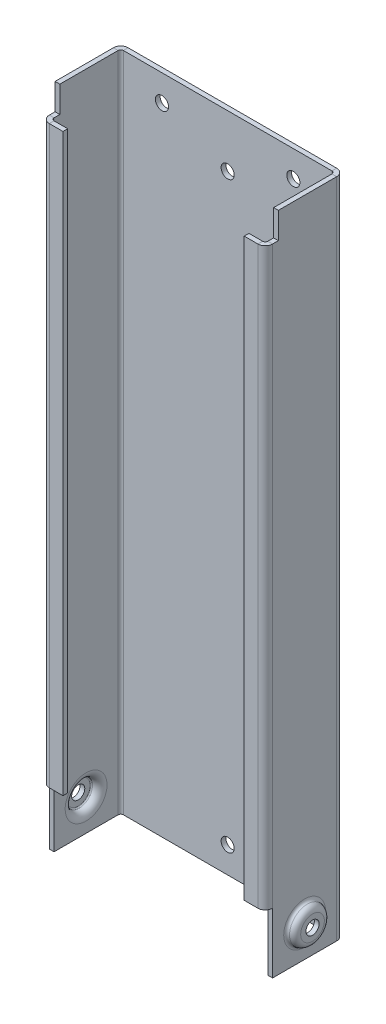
ISO-10303-21;
HEADER;
FILE_DESCRIPTION(('STEP AP214'),'2;1');
FILE_NAME('part.step','',(''),(''),'','','');
FILE_SCHEMA(('AUTOMOTIVE_DESIGN { 1 0 10303 214 1 1 1 1 }'));
ENDSEC;
DATA;
#1=APPLICATION_CONTEXT('core data for automotive mechanical design processes');
#2=APPLICATION_PROTOCOL_DEFINITION('international standard','automotive_design',2000,#1);
#3=PRODUCT_CONTEXT('',#1,'mechanical');
#4=PRODUCT('Part','Part','',(#3));
#5=PRODUCT_RELATED_PRODUCT_CATEGORY('part','',(#4));
#6=PRODUCT_DEFINITION_FORMATION('','',#4);
#7=PRODUCT_DEFINITION_CONTEXT('part definition',#1,'design');
#8=PRODUCT_DEFINITION('design','',#6,#7);
#9=PRODUCT_DEFINITION_SHAPE('','',#8);
#10=(LENGTH_UNIT() NAMED_UNIT(*) SI_UNIT(.MILLI.,.METRE.));
#11=(NAMED_UNIT(*) PLANE_ANGLE_UNIT() SI_UNIT($,.RADIAN.));
#12=(NAMED_UNIT(*) SI_UNIT($,.STERADIAN.) SOLID_ANGLE_UNIT());
#13=UNCERTAINTY_MEASURE_WITH_UNIT(LENGTH_MEASURE(1.E-05),#10,'distance_accuracy_value','');
#14=(GEOMETRIC_REPRESENTATION_CONTEXT(3) GLOBAL_UNCERTAINTY_ASSIGNED_CONTEXT((#13)) GLOBAL_UNIT_ASSIGNED_CONTEXT((#10,
#11,#12)) REPRESENTATION_CONTEXT('',''));
#15=CARTESIAN_POINT('',(0.,0.,0.));
#16=DIRECTION('',(0.,0.,1.));
#17=DIRECTION('',(1.,0.,0.));
#18=AXIS2_PLACEMENT_3D('',#15,#16,#17);
#19=CARTESIAN_POINT('',(-45.5000000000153,242.,25.));
#20=DIRECTION('',(0.,-1.,0.));
#21=DIRECTION('',(0.,0.,-1.));
#22=AXIS2_PLACEMENT_3D('',#19,#20,#21);
#23=PLANE('',#22);
#24=DIRECTION('',(1.,0.,0.));
#25=VECTOR('',#24,1.);
#26=CARTESIAN_POINT('',(-42.5,242.,28.2));
#27=LINE('',#26,#25);
#28=CARTESIAN_POINT('',(-39.7,242.,28.2));
#29=VERTEX_POINT('',#28);
#30=CARTESIAN_POINT('',(-34.5,242.,28.2));
#31=VERTEX_POINT('',#30);
#32=EDGE_CURVE('E371',#29,#31,#27,.T.);
#33=ORIENTED_EDGE('',*,*,#32,.F.);
#34=DIRECTION('',(0.,0.,1.));
#35=VECTOR('',#34,1.);
#36=CARTESIAN_POINT('',(-39.7,242.,28.2));
#37=LINE('',#36,#35);
#38=CARTESIAN_POINT('',(-39.7,242.,30.));
#39=VERTEX_POINT('',#38);
#40=EDGE_CURVE('E12',#29,#39,#37,.T.);
#41=ORIENTED_EDGE('',*,*,#40,.T.);
#42=DIRECTION('',(1.,0.,0.));
#43=VECTOR('',#42,1.);
#44=CARTESIAN_POINT('',(-45.5000000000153,242.,30.));
#45=LINE('',#44,#43);
#46=CARTESIAN_POINT('',(-34.5,242.,30.));
#47=VERTEX_POINT('',#46);
#48=EDGE_CURVE('E255',#39,#47,#45,.T.);
#49=ORIENTED_EDGE('',*,*,#48,.T.);
#50=DIRECTION('',(0.,0.,-1.));
#51=VECTOR('',#50,1.);
#52=CARTESIAN_POINT('',(-34.5,242.,28.2));
#53=LINE('',#52,#51);
#54=EDGE_CURVE('E374',#47,#31,#53,.T.);
#55=ORIENTED_EDGE('',*,*,#54,.T.);
#56=EDGE_LOOP('',(#33,#41,#49,#55));
#57=FACE_BOUND('',#56,.T.);
#58=ADVANCED_FACE('F48',(#57),#23,.F.);
#59=DIRECTION('',(0.,0.,1.));
#60=VECTOR('',#59,1.);
#61=CARTESIAN_POINT('',(-42.5,242.,0.));
#62=LINE('',#61,#60);
#63=CARTESIAN_POINT('',(-42.5,242.,25.));
#64=VERTEX_POINT('',#63);
#65=CARTESIAN_POINT('',(-42.5,242.,27.2));
#66=VERTEX_POINT('',#65);
#67=EDGE_CURVE('E350',#64,#66,#62,.T.);
#68=ORIENTED_EDGE('',*,*,#67,.T.);
#69=DIRECTION('',(1.,0.,0.));
#70=VECTOR('',#69,1.);
#71=CARTESIAN_POINT('',(-42.5,242.,27.2));
#72=LINE('',#71,#70);
#73=CARTESIAN_POINT('',(-40.7,242.,27.2));
#74=VERTEX_POINT('',#73);
#75=EDGE_CURVE('E57',#66,#74,#72,.T.);
#76=ORIENTED_EDGE('',*,*,#75,.T.);
#77=DIRECTION('',(0.,0.,1.));
#78=VECTOR('',#77,1.);
#79=CARTESIAN_POINT('',(-40.7,242.,0.));
#80=LINE('',#79,#78);
#81=CARTESIAN_POINT('',(-40.7,242.,25.));
#82=VERTEX_POINT('',#81);
#83=EDGE_CURVE('E365',#82,#74,#80,.T.);
#84=ORIENTED_EDGE('',*,*,#83,.F.);
#85=DIRECTION('',(1.,0.,0.));
#86=VECTOR('',#85,1.);
#87=CARTESIAN_POINT('',(-45.5000000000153,242.,25.));
#88=LINE('',#87,#86);
#89=EDGE_CURVE('E525',#64,#82,#88,.T.);
#90=ORIENTED_EDGE('',*,*,#89,.F.);
#91=EDGE_LOOP('',(#68,#76,#84,#90));
#92=FACE_BOUND('',#91,.T.);
#93=ADVANCED_FACE('F647',(#92),#23,.F.);
#94=CARTESIAN_POINT('',(-45.5000000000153,23.,30.));
#95=DIRECTION('',(0.,1.,0.));
#96=DIRECTION('',(0.,0.,1.));
#97=AXIS2_PLACEMENT_3D('',#94,#95,#96);
#98=PLANE('',#97);
#99=DIRECTION('',(1.,0.,0.));
#100=VECTOR('',#99,1.);
#101=CARTESIAN_POINT('',(-45.5000000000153,23.,30.));
#102=LINE('',#101,#100);
#103=CARTESIAN_POINT('',(-39.7,23.,30.));
#104=VERTEX_POINT('',#103);
#105=CARTESIAN_POINT('',(-34.5,23.,30.));
#106=VERTEX_POINT('',#105);
#107=EDGE_CURVE('E233',#104,#106,#102,.T.);
#108=ORIENTED_EDGE('',*,*,#107,.F.);
#109=DIRECTION('',(0.,0.,-1.));
#110=VECTOR('',#109,1.);
#111=CARTESIAN_POINT('',(-39.7,23.,30.));
#112=LINE('',#111,#110);
#113=CARTESIAN_POINT('',(-39.7,23.,28.2));
#114=VERTEX_POINT('',#113);
#115=EDGE_CURVE('E219',#104,#114,#112,.T.);
#116=ORIENTED_EDGE('',*,*,#115,.T.);
#117=DIRECTION('',(-1.,0.,0.));
#118=VECTOR('',#117,1.);
#119=CARTESIAN_POINT('',(-42.5,23.,28.2));
#120=LINE('',#119,#118);
#121=CARTESIAN_POINT('',(-34.5,23.,28.2));
#122=VERTEX_POINT('',#121);
#123=EDGE_CURVE('E506',#122,#114,#120,.T.);
#124=ORIENTED_EDGE('',*,*,#123,.F.);
#125=DIRECTION('',(0.,0.,1.));
#126=VECTOR('',#125,1.);
#127=CARTESIAN_POINT('',(-34.5,23.,28.2));
#128=LINE('',#127,#126);
#129=EDGE_CURVE('E236',#122,#106,#128,.T.);
#130=ORIENTED_EDGE('',*,*,#129,.T.);
#131=EDGE_LOOP('',(#108,#116,#124,#130));
#132=FACE_BOUND('',#131,.T.);
#133=ADVANCED_FACE('F234',(#132),#98,.F.);
#134=DIRECTION('',(0.,0.,-1.));
#135=VECTOR('',#134,1.);
#136=CARTESIAN_POINT('',(40.7,242.,0.));
#137=LINE('',#136,#135);
#138=CARTESIAN_POINT('',(40.7,242.,27.2));
#139=VERTEX_POINT('',#138);
#140=CARTESIAN_POINT('',(40.7,242.,25.));
#141=VERTEX_POINT('',#140);
#142=EDGE_CURVE('E331',#139,#141,#137,.T.);
#143=ORIENTED_EDGE('',*,*,#142,.F.);
#144=DIRECTION('',(1.,0.,0.));
#145=VECTOR('',#144,1.);
#146=CARTESIAN_POINT('',(40.7,242.,27.2));
#147=LINE('',#146,#145);
#148=CARTESIAN_POINT('',(42.5,242.,27.2));
#149=VERTEX_POINT('',#148);
#150=EDGE_CURVE('E230',#139,#149,#147,.T.);
#151=ORIENTED_EDGE('',*,*,#150,.T.);
#152=DIRECTION('',(0.,0.,-1.));
#153=VECTOR('',#152,1.);
#154=CARTESIAN_POINT('',(42.5,242.,0.));
#155=LINE('',#154,#153);
#156=CARTESIAN_POINT('',(42.5,242.,25.));
#157=VERTEX_POINT('',#156);
#158=EDGE_CURVE('E328',#149,#157,#155,.T.);
#159=ORIENTED_EDGE('',*,*,#158,.T.);
#160=EDGE_CURVE('E536',#141,#157,#88,.T.);
#161=ORIENTED_EDGE('',*,*,#160,.F.);
#162=EDGE_LOOP('',(#143,#151,#159,#161));
#163=FACE_BOUND('',#162,.T.);
#164=ADVANCED_FACE('F325',(#163),#23,.F.);
#165=CARTESIAN_POINT('',(34.5,242.,30.));
#166=VERTEX_POINT('',#165);
#167=CARTESIAN_POINT('',(39.7,242.,30.));
#168=VERTEX_POINT('',#167);
#169=EDGE_CURVE('E534',#166,#168,#45,.T.);
#170=ORIENTED_EDGE('',*,*,#169,.T.);
#171=DIRECTION('',(0.,0.,-1.));
#172=VECTOR('',#171,1.);
#173=CARTESIAN_POINT('',(39.7,242.,30.));
#174=LINE('',#173,#172);
#175=CARTESIAN_POINT('',(39.7,242.,28.2));
#176=VERTEX_POINT('',#175);
#177=EDGE_CURVE('E319',#168,#176,#174,.T.);
#178=ORIENTED_EDGE('',*,*,#177,.T.);
#179=DIRECTION('',(1.,0.,0.));
#180=VECTOR('',#179,1.);
#181=CARTESIAN_POINT('',(42.5,242.,28.2));
#182=LINE('',#181,#180);
#183=CARTESIAN_POINT('',(34.5,242.,28.2));
#184=VERTEX_POINT('',#183);
#185=EDGE_CURVE('E357',#184,#176,#182,.T.);
#186=ORIENTED_EDGE('',*,*,#185,.F.);
#187=DIRECTION('',(0.,0.,1.));
#188=VECTOR('',#187,1.);
#189=CARTESIAN_POINT('',(34.5,242.,30.));
#190=LINE('',#189,#188);
#191=EDGE_CURVE('E363',#184,#166,#190,.T.);
#192=ORIENTED_EDGE('',*,*,#191,.T.);
#193=EDGE_LOOP('',(#170,#178,#186,#192));
#194=FACE_BOUND('',#193,.T.);
#195=ADVANCED_FACE('F630',(#194),#23,.F.);
#196=CARTESIAN_POINT('',(-39.7,252.,28.2));
#197=DIRECTION('',(0.,1.,0.));
#198=DIRECTION('',(0.,0.,1.));
#199=AXIS2_PLACEMENT_3D('',#196,#197,#198);
#200=PLANE('',#199);
#201=DIRECTION('',(1.,0.,0.));
#202=VECTOR('',#201,1.);
#203=CARTESIAN_POINT('',(-45.5000000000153,252.,25.));
#204=LINE('',#203,#202);
#205=CARTESIAN_POINT('',(-42.5,252.,25.));
#206=VERTEX_POINT('',#205);
#207=CARTESIAN_POINT('',(-40.7,252.,25.));
#208=VERTEX_POINT('',#207);
#209=EDGE_CURVE('E533',#206,#208,#204,.T.);
#210=ORIENTED_EDGE('',*,*,#209,.T.);
#211=DIRECTION('',(0.,0.,-1.));
#212=VECTOR('',#211,1.);
#213=CARTESIAN_POINT('',(-40.7,252.,0.));
#214=LINE('',#213,#212);
#215=CARTESIAN_POINT('',(-40.7,252.,2.8));
#216=VERTEX_POINT('',#215);
#217=EDGE_CURVE('E436',#208,#216,#214,.T.);
#218=ORIENTED_EDGE('',*,*,#217,.T.);
#219=DIRECTION('',(-1.,0.,0.));
#220=VECTOR('',#219,1.);
#221=CARTESIAN_POINT('',(-40.7,252.,2.8));
#222=LINE('',#221,#220);
#223=CARTESIAN_POINT('',(-42.5,252.,2.8));
#224=VERTEX_POINT('',#223);
#225=EDGE_CURVE('E302',#216,#224,#222,.T.);
#226=ORIENTED_EDGE('',*,*,#225,.T.);
#227=DIRECTION('',(0.,0.,-1.));
#228=VECTOR('',#227,1.);
#229=CARTESIAN_POINT('',(-42.5,252.,0.));
#230=LINE('',#229,#228);
#231=EDGE_CURVE('E434',#206,#224,#230,.T.);
#232=ORIENTED_EDGE('',*,*,#231,.F.);
#233=EDGE_LOOP('',(#210,#218,#226,#232));
#234=FACE_BOUND('',#233,.T.);
#235=ADVANCED_FACE('F50',(#234),#200,.T.);
#236=CARTESIAN_POINT('',(-39.7,252.,0.));
#237=DIRECTION('',(0.,1.,0.));
#238=DIRECTION('',(0.,0.,1.));
#239=AXIS2_PLACEMENT_3D('',#236,#237,#238);
#240=PLANE('',#239);
#241=DIRECTION('',(0.,0.,1.));
#242=VECTOR('',#241,1.);
#243=CARTESIAN_POINT('',(-39.7,252.,0.));
#244=LINE('',#243,#242);
#245=CARTESIAN_POINT('',(-39.7,252.,0.));
#246=VERTEX_POINT('',#245);
#247=CARTESIAN_POINT('',(-39.7,252.,1.8));
#248=VERTEX_POINT('',#247);
#249=EDGE_CURVE('E305',#246,#248,#244,.T.);
#250=ORIENTED_EDGE('',*,*,#249,.F.);
#251=CARTESIAN_POINT('',(-39.7,252.,2.8));
#252=DIRECTION('',(0.,1.,0.));
#253=DIRECTION('',(0.,0.,1.));
#254=AXIS2_PLACEMENT_3D('',#251,#252,#253);
#255=CIRCLE('',#254,2.8);
#256=EDGE_CURVE('E431',#224,#246,#255,.F.);
#257=ORIENTED_EDGE('',*,*,#256,.F.);
#258=ORIENTED_EDGE('',*,*,#225,.F.);
#259=CARTESIAN_POINT('',(-39.7,252.,2.8));
#260=DIRECTION('',(0.,1.,0.));
#261=DIRECTION('',(1.,0.,0.));
#262=AXIS2_PLACEMENT_3D('',#259,#260,#261);
#263=CIRCLE('',#262,1.);
#264=EDGE_CURVE('E438',#216,#248,#263,.F.);
#265=ORIENTED_EDGE('',*,*,#264,.T.);
#266=EDGE_LOOP('',(#250,#257,#258,#265));
#267=FACE_BOUND('',#266,.T.);
#268=ADVANCED_FACE('F681',(#267),#240,.T.);
#269=CARTESIAN_POINT('',(-40.7,252.,2.8));
#270=DIRECTION('',(0.,1.,0.));
#271=DIRECTION('',(0.,0.,1.));
#272=AXIS2_PLACEMENT_3D('',#269,#270,#271);
#273=PLANE('',#272);
#274=DIRECTION('',(1.,0.,0.));
#275=VECTOR('',#274,1.);
#276=CARTESIAN_POINT('',(-42.5,252.,0.));
#277=LINE('',#276,#275);
#278=CARTESIAN_POINT('',(39.7,252.,0.));
#279=VERTEX_POINT('',#278);
#280=EDGE_CURVE('E428',#246,#279,#277,.T.);
#281=ORIENTED_EDGE('',*,*,#280,.F.);
#282=ORIENTED_EDGE('',*,*,#249,.T.);
#283=DIRECTION('',(1.,0.,0.));
#284=VECTOR('',#283,1.);
#285=CARTESIAN_POINT('',(-42.5,252.,1.8));
#286=LINE('',#285,#284);
#287=CARTESIAN_POINT('',(39.7,252.,1.8));
#288=VERTEX_POINT('',#287);
#289=EDGE_CURVE('E441',#248,#288,#286,.T.);
#290=ORIENTED_EDGE('',*,*,#289,.T.);
#291=DIRECTION('',(0.,0.,-1.));
#292=VECTOR('',#291,1.);
#293=CARTESIAN_POINT('',(39.7,252.,1.8));
#294=LINE('',#293,#292);
#295=EDGE_CURVE('E294',#288,#279,#294,.T.);
#296=ORIENTED_EDGE('',*,*,#295,.T.);
#297=EDGE_LOOP('',(#281,#282,#290,#296));
#298=FACE_BOUND('',#297,.T.);
#299=ADVANCED_FACE('F1417',(#298),#273,.T.);
#300=CARTESIAN_POINT('',(-42.5,0.,2.8));
#301=DIRECTION('',(0.,-1.,0.));
#302=DIRECTION('',(0.,0.,-1.));
#303=AXIS2_PLACEMENT_3D('',#300,#301,#302);
#304=PLANE('',#303);
#305=DIRECTION('',(1.,0.,0.));
#306=VECTOR('',#305,1.);
#307=CARTESIAN_POINT('',(-42.5,0.,2.8));
#308=LINE('',#307,#306);
#309=CARTESIAN_POINT('',(-42.5,0.,2.8));
#310=VERTEX_POINT('',#309);
#311=CARTESIAN_POINT('',(-40.7,0.,2.8));
#312=VERTEX_POINT('',#311);
#313=EDGE_CURVE('E300',#310,#312,#308,.T.);
#314=ORIENTED_EDGE('',*,*,#313,.F.);
#315=CARTESIAN_POINT('',(-39.7,0.,2.8));
#316=DIRECTION('',(0.,1.,0.));
#317=DIRECTION('',(0.,0.,1.));
#318=AXIS2_PLACEMENT_3D('',#315,#316,#317);
#319=CIRCLE('',#318,2.8);
#320=CARTESIAN_POINT('',(-39.7,0.,0.));
#321=VERTEX_POINT('',#320);
#322=EDGE_CURVE('E459',#310,#321,#319,.F.);
#323=ORIENTED_EDGE('',*,*,#322,.T.);
#324=DIRECTION('',(0.,0.,-1.));
#325=VECTOR('',#324,1.);
#326=CARTESIAN_POINT('',(-39.7,0.,1.8));
#327=LINE('',#326,#325);
#328=CARTESIAN_POINT('',(-39.7,0.,1.8));
#329=VERTEX_POINT('',#328);
#330=EDGE_CURVE('E298',#329,#321,#327,.T.);
#331=ORIENTED_EDGE('',*,*,#330,.F.);
#332=CARTESIAN_POINT('',(-39.7,0.,2.8));
#333=DIRECTION('',(0.,1.,0.));
#334=DIRECTION('',(1.,0.,0.));
#335=AXIS2_PLACEMENT_3D('',#332,#333,#334);
#336=CIRCLE('',#335,1.);
#337=EDGE_CURVE('E468',#312,#329,#336,.F.);
#338=ORIENTED_EDGE('',*,*,#337,.F.);
#339=EDGE_LOOP('',(#314,#323,#331,#338));
#340=FACE_BOUND('',#339,.T.);
#341=ADVANCED_FACE('F1404',(#340),#304,.T.);
#342=CARTESIAN_POINT('',(-39.7,0.,1.8));
#343=DIRECTION('',(0.,-1.,0.));
#344=DIRECTION('',(0.,0.,-1.));
#345=AXIS2_PLACEMENT_3D('',#342,#343,#344);
#346=PLANE('',#345);
#347=DIRECTION('',(0.,0.,-1.));
#348=VECTOR('',#347,1.);
#349=CARTESIAN_POINT('',(-42.5,0.,0.));
#350=LINE('',#349,#348);
#351=CARTESIAN_POINT('',(-42.5,0.,27.2));
#352=VERTEX_POINT('',#351);
#353=EDGE_CURVE('E462',#352,#310,#350,.T.);
#354=ORIENTED_EDGE('',*,*,#353,.T.);
#355=ORIENTED_EDGE('',*,*,#313,.T.);
#356=DIRECTION('',(0.,0.,-1.));
#357=VECTOR('',#356,1.);
#358=CARTESIAN_POINT('',(-40.7,0.,0.));
#359=LINE('',#358,#357);
#360=CARTESIAN_POINT('',(-40.7,0.,27.2));
#361=VERTEX_POINT('',#360);
#362=EDGE_CURVE('E465',#361,#312,#359,.T.);
#363=ORIENTED_EDGE('',*,*,#362,.F.);
#364=DIRECTION('',(-1.,0.,0.));
#365=VECTOR('',#364,1.);
#366=CARTESIAN_POINT('',(-40.7,0.,27.2));
#367=LINE('',#366,#365);
#368=EDGE_CURVE('E307',#361,#352,#367,.T.);
#369=ORIENTED_EDGE('',*,*,#368,.T.);
#370=EDGE_LOOP('',(#354,#355,#363,#369));
#371=FACE_BOUND('',#370,.T.);
#372=ADVANCED_FACE('F1392',(#371),#346,.T.);
#373=CARTESIAN_POINT('',(42.5,252.,2.8));
#374=DIRECTION('',(0.,1.,0.));
#375=DIRECTION('',(0.,0.,1.));
#376=AXIS2_PLACEMENT_3D('',#373,#374,#375);
#377=PLANE('',#376);
#378=DIRECTION('',(-1.,0.,0.));
#379=VECTOR('',#378,1.);
#380=CARTESIAN_POINT('',(42.5,252.,2.8));
#381=LINE('',#380,#379);
#382=CARTESIAN_POINT('',(42.5,252.,2.8));
#383=VERTEX_POINT('',#382);
#384=CARTESIAN_POINT('',(40.7,252.,2.8));
#385=VERTEX_POINT('',#384);
#386=EDGE_CURVE('E296',#383,#385,#381,.T.);
#387=ORIENTED_EDGE('',*,*,#386,.F.);
#388=CARTESIAN_POINT('',(39.7,252.,2.8));
#389=DIRECTION('',(0.,1.,0.));
#390=DIRECTION('',(0.,0.,1.));
#391=AXIS2_PLACEMENT_3D('',#388,#389,#390);
#392=CIRCLE('',#391,2.8);
#393=EDGE_CURVE('E424',#279,#383,#392,.F.);
#394=ORIENTED_EDGE('',*,*,#393,.F.);
#395=ORIENTED_EDGE('',*,*,#295,.F.);
#396=CARTESIAN_POINT('',(39.7,252.,2.8));
#397=DIRECTION('',(0.,1.,0.));
#398=DIRECTION('',(1.,0.,0.));
#399=AXIS2_PLACEMENT_3D('',#396,#397,#398);
#400=CIRCLE('',#399,1.);
#401=EDGE_CURVE('E444',#288,#385,#400,.F.);
#402=ORIENTED_EDGE('',*,*,#401,.T.);
#403=EDGE_LOOP('',(#387,#394,#395,#402));
#404=FACE_BOUND('',#403,.T.);
#405=ADVANCED_FACE('F1379',(#404),#377,.T.);
#406=CARTESIAN_POINT('',(39.7,252.,1.8));
#407=DIRECTION('',(0.,1.,0.));
#408=DIRECTION('',(0.,0.,1.));
#409=AXIS2_PLACEMENT_3D('',#406,#407,#408);
#410=PLANE('',#409);
#411=CARTESIAN_POINT('',(40.7,252.,25.));
#412=VERTEX_POINT('',#411);
#413=CARTESIAN_POINT('',(42.5,252.,25.));
#414=VERTEX_POINT('',#413);
#415=EDGE_CURVE('E530',#412,#414,#204,.T.);
#416=ORIENTED_EDGE('',*,*,#415,.T.);
#417=DIRECTION('',(0.,0.,1.));
#418=VECTOR('',#417,1.);
#419=CARTESIAN_POINT('',(42.5,252.,0.));
#420=LINE('',#419,#418);
#421=EDGE_CURVE('E422',#383,#414,#420,.T.);
#422=ORIENTED_EDGE('',*,*,#421,.F.);
#423=ORIENTED_EDGE('',*,*,#386,.T.);
#424=DIRECTION('',(0.,0.,1.));
#425=VECTOR('',#424,1.);
#426=CARTESIAN_POINT('',(40.7,252.,0.));
#427=LINE('',#426,#425);
#428=EDGE_CURVE('E447',#385,#412,#427,.T.);
#429=ORIENTED_EDGE('',*,*,#428,.T.);
#430=EDGE_LOOP('',(#416,#422,#423,#429));
#431=FACE_BOUND('',#430,.T.);
#432=ADVANCED_FACE('F1367',(#431),#410,.T.);
#433=CARTESIAN_POINT('',(39.7,0.,0.));
#434=DIRECTION('',(0.,-1.,0.));
#435=DIRECTION('',(0.,0.,-1.));
#436=AXIS2_PLACEMENT_3D('',#433,#434,#435);
#437=PLANE('',#436);
#438=DIRECTION('',(0.,0.,1.));
#439=VECTOR('',#438,1.);
#440=CARTESIAN_POINT('',(39.7,0.,0.));
#441=LINE('',#440,#439);
#442=CARTESIAN_POINT('',(39.7,0.,0.));
#443=VERTEX_POINT('',#442);
#444=CARTESIAN_POINT('',(39.7,0.,1.8));
#445=VERTEX_POINT('',#444);
#446=EDGE_CURVE('E292',#443,#445,#441,.T.);
#447=ORIENTED_EDGE('',*,*,#446,.F.);
#448=CARTESIAN_POINT('',(39.7,0.,2.8));
#449=DIRECTION('',(0.,1.,0.));
#450=DIRECTION('',(0.,0.,1.));
#451=AXIS2_PLACEMENT_3D('',#448,#449,#450);
#452=CIRCLE('',#451,2.8);
#453=CARTESIAN_POINT('',(42.5,0.,2.8));
#454=VERTEX_POINT('',#453);
#455=EDGE_CURVE('E453',#443,#454,#452,.F.);
#456=ORIENTED_EDGE('',*,*,#455,.T.);
#457=DIRECTION('',(1.,0.,0.));
#458=VECTOR('',#457,1.);
#459=CARTESIAN_POINT('',(40.7,0.,2.8));
#460=LINE('',#459,#458);
#461=CARTESIAN_POINT('',(40.7,0.,2.8));
#462=VERTEX_POINT('',#461);
#463=EDGE_CURVE('E290',#462,#454,#460,.T.);
#464=ORIENTED_EDGE('',*,*,#463,.F.);
#465=CARTESIAN_POINT('',(39.7,0.,2.8));
#466=DIRECTION('',(0.,1.,0.));
#467=DIRECTION('',(1.,0.,0.));
#468=AXIS2_PLACEMENT_3D('',#465,#466,#467);
#469=CIRCLE('',#468,1.);
#470=EDGE_CURVE('E474',#445,#462,#469,.F.);
#471=ORIENTED_EDGE('',*,*,#470,.F.);
#472=EDGE_LOOP('',(#447,#456,#464,#471));
#473=FACE_BOUND('',#472,.T.);
#474=ADVANCED_FACE('F603',(#473),#437,.T.);
#475=CARTESIAN_POINT('',(40.7,0.,2.8));
#476=DIRECTION('',(0.,-1.,0.));
#477=DIRECTION('',(0.,0.,-1.));
#478=AXIS2_PLACEMENT_3D('',#475,#476,#477);
#479=PLANE('',#478);
#480=DIRECTION('',(1.,0.,0.));
#481=VECTOR('',#480,1.);
#482=CARTESIAN_POINT('',(-42.5,0.,0.));
#483=LINE('',#482,#481);
#484=EDGE_CURVE('E456',#321,#443,#483,.T.);
#485=ORIENTED_EDGE('',*,*,#484,.T.);
#486=ORIENTED_EDGE('',*,*,#446,.T.);
#487=DIRECTION('',(1.,0.,0.));
#488=VECTOR('',#487,1.);
#489=CARTESIAN_POINT('',(-42.5,0.,1.8));
#490=LINE('',#489,#488);
#491=EDGE_CURVE('E471',#329,#445,#490,.T.);
#492=ORIENTED_EDGE('',*,*,#491,.F.);
#493=ORIENTED_EDGE('',*,*,#330,.T.);
#494=EDGE_LOOP('',(#485,#486,#492,#493));
#495=FACE_BOUND('',#494,.T.);
#496=ADVANCED_FACE('F1344',(#495),#479,.T.);
#497=CARTESIAN_POINT('',(39.7,0.,28.2));
#498=DIRECTION('',(0.,-1.,0.));
#499=DIRECTION('',(0.,0.,-1.));
#500=AXIS2_PLACEMENT_3D('',#497,#498,#499);
#501=PLANE('',#500);
#502=DIRECTION('',(0.,0.,1.));
#503=VECTOR('',#502,1.);
#504=CARTESIAN_POINT('',(42.5,0.,0.));
#505=LINE('',#504,#503);
#506=CARTESIAN_POINT('',(42.5,0.,27.2));
#507=VERTEX_POINT('',#506);
#508=EDGE_CURVE('E421',#454,#507,#505,.T.);
#509=ORIENTED_EDGE('',*,*,#508,.T.);
#510=DIRECTION('',(-1.,0.,0.));
#511=VECTOR('',#510,1.);
#512=CARTESIAN_POINT('',(42.5,0.,27.2));
#513=LINE('',#512,#511);
#514=CARTESIAN_POINT('',(40.7,0.,27.2));
#515=VERTEX_POINT('',#514);
#516=EDGE_CURVE('E287',#507,#515,#513,.T.);
#517=ORIENTED_EDGE('',*,*,#516,.T.);
#518=DIRECTION('',(0.,0.,1.));
#519=VECTOR('',#518,1.);
#520=CARTESIAN_POINT('',(40.7,0.,0.));
#521=LINE('',#520,#519);
#522=EDGE_CURVE('E425',#462,#515,#521,.T.);
#523=ORIENTED_EDGE('',*,*,#522,.F.);
#524=ORIENTED_EDGE('',*,*,#463,.T.);
#525=EDGE_LOOP('',(#509,#517,#523,#524));
#526=FACE_BOUND('',#525,.T.);
#527=ADVANCED_FACE('F607',(#526),#501,.T.);
#528=CARTESIAN_POINT('',(42.5,252.,28.2));
#529=DIRECTION('',(0.,0.,1.));
#530=DIRECTION('',(1.,0.,0.));
#531=AXIS2_PLACEMENT_3D('',#528,#529,#530);
#532=PLANE('',#531);
#533=DIRECTION('',(0.,-1.,0.));
#534=VECTOR('',#533,1.);
#535=CARTESIAN_POINT('',(34.5,252.,28.2));
#536=LINE('',#535,#534);
#537=CARTESIAN_POINT('',(34.5,23.,28.2));
#538=VERTEX_POINT('',#537);
#539=EDGE_CURVE('E284',#184,#538,#536,.T.);
#540=ORIENTED_EDGE('',*,*,#539,.F.);
#541=ORIENTED_EDGE('',*,*,#185,.T.);
#542=DIRECTION('',(0.,-1.,0.));
#543=VECTOR('',#542,1.);
#544=CARTESIAN_POINT('',(39.7,252.,28.2));
#545=LINE('',#544,#543);
#546=CARTESIAN_POINT('',(39.7,23.,28.2));
#547=VERTEX_POINT('',#546);
#548=EDGE_CURVE('E450',#176,#547,#545,.T.);
#549=ORIENTED_EDGE('',*,*,#548,.T.);
#550=DIRECTION('',(-1.,0.,0.));
#551=VECTOR('',#550,1.);
#552=CARTESIAN_POINT('',(42.5,23.,28.2));
#553=LINE('',#552,#551);
#554=EDGE_CURVE('E516',#547,#538,#553,.T.);
#555=ORIENTED_EDGE('',*,*,#554,.T.);
#556=EDGE_LOOP('',(#540,#541,#549,#555));
#557=FACE_BOUND('',#556,.T.);
#558=ADVANCED_FACE('F627',(#557),#532,.F.);
#559=CARTESIAN_POINT('',(34.5,252.,30.));
#560=DIRECTION('',(-1.,0.,0.));
#561=DIRECTION('',(0.,0.,1.));
#562=AXIS2_PLACEMENT_3D('',#559,#560,#561);
#563=PLANE('',#562);
#564=ORIENTED_EDGE('',*,*,#191,.F.);
#565=ORIENTED_EDGE('',*,*,#539,.T.);
#566=DIRECTION('',(0.,0.,-1.));
#567=VECTOR('',#566,1.);
#568=CARTESIAN_POINT('',(34.5,23.,30.));
#569=LINE('',#568,#567);
#570=CARTESIAN_POINT('',(34.5,23.,30.));
#571=VERTEX_POINT('',#570);
#572=EDGE_CURVE('E514',#571,#538,#569,.T.);
#573=ORIENTED_EDGE('',*,*,#572,.F.);
#574=DIRECTION('',(0.,-1.,0.));
#575=VECTOR('',#574,1.);
#576=CARTESIAN_POINT('',(34.5,252.,30.));
#577=LINE('',#576,#575);
#578=EDGE_CURVE('E281',#166,#571,#577,.T.);
#579=ORIENTED_EDGE('',*,*,#578,.F.);
#580=EDGE_LOOP('',(#564,#565,#573,#579));
#581=FACE_BOUND('',#580,.T.);
#582=ADVANCED_FACE('F634',(#581),#563,.T.);
#583=CARTESIAN_POINT('',(42.5,252.,30.));
#584=DIRECTION('',(0.,0.,1.));
#585=DIRECTION('',(1.,0.,0.));
#586=AXIS2_PLACEMENT_3D('',#583,#584,#585);
#587=PLANE('',#586);
#588=ORIENTED_EDGE('',*,*,#169,.F.);
#589=ORIENTED_EDGE('',*,*,#578,.T.);
#590=CARTESIAN_POINT('',(39.7,23.,30.));
#591=VERTEX_POINT('',#590);
#592=EDGE_CURVE('E241',#571,#591,#102,.T.);
#593=ORIENTED_EDGE('',*,*,#592,.T.);
#594=DIRECTION('',(0.,-1.,0.));
#595=VECTOR('',#594,1.);
#596=CARTESIAN_POINT('',(39.7,252.,30.));
#597=LINE('',#596,#595);
#598=EDGE_CURVE('E278',#168,#591,#597,.T.);
#599=ORIENTED_EDGE('',*,*,#598,.F.);
#600=EDGE_LOOP('',(#588,#589,#593,#599));
#601=FACE_BOUND('',#600,.T.);
#602=ADVANCED_FACE('F637',(#601),#587,.T.);
#603=CARTESIAN_POINT('',(39.7,252.,27.2));
#604=DIRECTION('',(0.,-1.,0.));
#605=DIRECTION('',(0.,0.,-1.));
#606=AXIS2_PLACEMENT_3D('',#603,#604,#605);
#607=CYLINDRICAL_SURFACE('',#606,2.8);
#608=CARTESIAN_POINT('',(39.7,242.,27.2));
#609=DIRECTION('',(0.,-1.,0.));
#610=DIRECTION('',(0.,0.,-1.));
#611=AXIS2_PLACEMENT_3D('',#608,#609,#610);
#612=CIRCLE('',#611,2.8);
#613=EDGE_CURVE('E335',#168,#149,#612,.F.);
#614=ORIENTED_EDGE('',*,*,#613,.F.);
#615=ORIENTED_EDGE('',*,*,#598,.T.);
#616=CARTESIAN_POINT('',(39.7,23.,27.2));
#617=DIRECTION('',(0.,1.,0.));
#618=DIRECTION('',(0.,0.,1.));
#619=AXIS2_PLACEMENT_3D('',#616,#617,#618);
#620=CIRCLE('',#619,2.8);
#621=CARTESIAN_POINT('',(42.5,23.,27.2));
#622=VERTEX_POINT('',#621);
#623=EDGE_CURVE('E251',#622,#591,#620,.F.);
#624=ORIENTED_EDGE('',*,*,#623,.F.);
#625=DIRECTION('',(0.,-1.,0.));
#626=VECTOR('',#625,1.);
#627=CARTESIAN_POINT('',(42.5,252.,27.2));
#628=LINE('',#627,#626);
#629=EDGE_CURVE('E275',#149,#622,#628,.T.);
#630=ORIENTED_EDGE('',*,*,#629,.F.);
#631=EDGE_LOOP('',(#614,#615,#624,#630));
#632=FACE_BOUND('',#631,.T.);
#633=ADVANCED_FACE('F353',(#632),#607,.T.);
#634=CARTESIAN_POINT('',(42.5,252.,0.));
#635=DIRECTION('',(1.,0.,0.));
#636=DIRECTION('',(0.,0.,-1.));
#637=AXIS2_PLACEMENT_3D('',#634,#635,#636);
#638=PLANE('',#637);
#639=DIRECTION('',(0.,1.,0.));
#640=VECTOR('',#639,1.);
#641=CARTESIAN_POINT('',(42.5,252.,25.));
#642=LINE('',#641,#640);
#643=EDGE_CURVE('E349',#157,#414,#642,.T.);
#644=ORIENTED_EDGE('',*,*,#643,.F.);
#645=ORIENTED_EDGE('',*,*,#158,.F.);
#646=ORIENTED_EDGE('',*,*,#629,.T.);
#647=DIRECTION('',(0.,1.,0.));
#648=VECTOR('',#647,1.);
#649=CARTESIAN_POINT('',(42.5,252.,27.2));
#650=LINE('',#649,#648);
#651=EDGE_CURVE('E519',#507,#622,#650,.T.);
#652=ORIENTED_EDGE('',*,*,#651,.F.);
#653=ORIENTED_EDGE('',*,*,#508,.F.);
#654=DIRECTION('',(0.,-1.,0.));
#655=VECTOR('',#654,1.);
#656=CARTESIAN_POINT('',(42.5,252.,2.8));
#657=LINE('',#656,#655);
#658=EDGE_CURVE('E272',#383,#454,#657,.T.);
#659=ORIENTED_EDGE('',*,*,#658,.F.);
#660=ORIENTED_EDGE('',*,*,#421,.T.);
#661=EDGE_LOOP('',(#644,#645,#646,#652,#653,#659,#660));
#662=FACE_BOUND('',#661,.T.);
#663=CARTESIAN_POINT('',(42.5000000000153,12.,15.));
#664=DIRECTION('',(-1.,0.,0.));
#665=DIRECTION('',(0.,0.,1.));
#666=AXIS2_PLACEMENT_3D('',#663,#664,#665);
#667=CIRCLE('',#666,7.96410161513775);
#668=CARTESIAN_POINT('',(42.5000000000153,12.,22.9641016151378));
#669=VERTEX_POINT('',#668);
#670=EDGE_CURVE('E390',#669,#669,#667,.T.);
#671=ORIENTED_EDGE('',*,*,#670,.T.);
#672=EDGE_LOOP('',(#671));
#673=FACE_BOUND('',#672,.T.);
#674=ADVANCED_FACE('F345',(#662,#673),#638,.T.);
#675=CARTESIAN_POINT('',(39.7,252.,2.8));
#676=DIRECTION('',(0.,-1.,0.));
#677=DIRECTION('',(0.,0.,-1.));
#678=AXIS2_PLACEMENT_3D('',#675,#676,#677);
#679=CYLINDRICAL_SURFACE('',#678,2.8);
#680=ORIENTED_EDGE('',*,*,#455,.F.);
#681=DIRECTION('',(0.,-1.,0.));
#682=VECTOR('',#681,1.);
#683=CARTESIAN_POINT('',(39.7,252.,0.));
#684=LINE('',#683,#682);
#685=EDGE_CURVE('E269',#279,#443,#684,.T.);
#686=ORIENTED_EDGE('',*,*,#685,.F.);
#687=ORIENTED_EDGE('',*,*,#393,.T.);
#688=ORIENTED_EDGE('',*,*,#658,.T.);
#689=EDGE_LOOP('',(#680,#686,#687,#688));
#690=FACE_BOUND('',#689,.T.);
#691=ADVANCED_FACE('F611',(#690),#679,.T.);
#692=CARTESIAN_POINT('',(-42.5,252.,0.));
#693=DIRECTION('',(0.,0.,-1.));
#694=DIRECTION('',(-1.,0.,0.));
#695=AXIS2_PLACEMENT_3D('',#692,#693,#694);
#696=PLANE('',#695);
#697=CARTESIAN_POINT('',(0.,10.,0.));
#698=DIRECTION('',(0.,0.,1.));
#699=DIRECTION('',(1.,0.,0.));
#700=AXIS2_PLACEMENT_3D('',#697,#698,#699);
#701=CIRCLE('',#700,2.5);
#702=CARTESIAN_POINT('',(2.5,10.,0.));
#703=VERTEX_POINT('',#702);
#704=EDGE_CURVE('E546',#703,#703,#701,.T.);
#705=ORIENTED_EDGE('',*,*,#704,.T.);
#706=EDGE_LOOP('',(#705));
#707=FACE_BOUND('',#706,.T.);
#708=CARTESIAN_POINT('',(0.,232.,0.));
#709=DIRECTION('',(0.,0.,1.));
#710=DIRECTION('',(1.,0.,0.));
#711=AXIS2_PLACEMENT_3D('',#708,#709,#710);
#712=CIRCLE('',#711,2.5);
#713=CARTESIAN_POINT('',(2.5,232.,0.));
#714=VERTEX_POINT('',#713);
#715=EDGE_CURVE('E559',#714,#714,#712,.T.);
#716=ORIENTED_EDGE('',*,*,#715,.T.);
#717=EDGE_LOOP('',(#716));
#718=FACE_BOUND('',#717,.T.);
#719=CARTESIAN_POINT('',(-25.,242.,0.));
#720=DIRECTION('',(0.,0.,1.));
#721=DIRECTION('',(1.,0.,0.));
#722=AXIS2_PLACEMENT_3D('',#719,#720,#721);
#723=CIRCLE('',#722,2.5);
#724=CARTESIAN_POINT('',(-22.5,242.,0.));
#725=VERTEX_POINT('',#724);
#726=EDGE_CURVE('E553',#725,#725,#723,.T.);
#727=ORIENTED_EDGE('',*,*,#726,.T.);
#728=EDGE_LOOP('',(#727));
#729=FACE_BOUND('',#728,.T.);
#730=CARTESIAN_POINT('',(25.,242.,0.));
#731=DIRECTION('',(0.,0.,1.));
#732=DIRECTION('',(1.,0.,0.));
#733=AXIS2_PLACEMENT_3D('',#730,#731,#732);
#734=CIRCLE('',#733,2.5);
#735=CARTESIAN_POINT('',(27.5,242.,0.));
#736=VERTEX_POINT('',#735);
#737=EDGE_CURVE('E547',#736,#736,#734,.T.);
#738=ORIENTED_EDGE('',*,*,#737,.T.);
#739=EDGE_LOOP('',(#738));
#740=FACE_BOUND('',#739,.T.);
#741=ORIENTED_EDGE('',*,*,#484,.F.);
#742=DIRECTION('',(0.,-1.,0.));
#743=VECTOR('',#742,1.);
#744=CARTESIAN_POINT('',(-39.7,252.,0.));
#745=LINE('',#744,#743);
#746=EDGE_CURVE('E266',#246,#321,#745,.T.);
#747=ORIENTED_EDGE('',*,*,#746,.F.);
#748=ORIENTED_EDGE('',*,*,#280,.T.);
#749=ORIENTED_EDGE('',*,*,#685,.T.);
#750=EDGE_LOOP('',(#741,#747,#748,#749));
#751=FACE_BOUND('',#750,.T.);
#752=ADVANCED_FACE('F571',(#707,#718,#729,#740,#751),#696,.T.);
#753=CARTESIAN_POINT('',(-39.7,252.,2.8));
#754=DIRECTION('',(0.,-1.,0.));
#755=DIRECTION('',(0.,0.,-1.));
#756=AXIS2_PLACEMENT_3D('',#753,#754,#755);
#757=CYLINDRICAL_SURFACE('',#756,2.8);
#758=ORIENTED_EDGE('',*,*,#322,.F.);
#759=DIRECTION('',(0.,-1.,0.));
#760=VECTOR('',#759,1.);
#761=CARTESIAN_POINT('',(-42.5,252.,2.8));
#762=LINE('',#761,#760);
#763=EDGE_CURVE('E258',#224,#310,#762,.T.);
#764=ORIENTED_EDGE('',*,*,#763,.F.);
#765=ORIENTED_EDGE('',*,*,#256,.T.);
#766=ORIENTED_EDGE('',*,*,#746,.T.);
#767=EDGE_LOOP('',(#758,#764,#765,#766));
#768=FACE_BOUND('',#767,.T.);
#769=ADVANCED_FACE('F781',(#768),#757,.T.);
#770=CARTESIAN_POINT('',(-42.5,252.,0.));
#771=DIRECTION('',(-1.,0.,0.));
#772=DIRECTION('',(0.,0.,1.));
#773=AXIS2_PLACEMENT_3D('',#770,#771,#772);
#774=PLANE('',#773);
#775=DIRECTION('',(0.,-1.,0.));
#776=VECTOR('',#775,1.);
#777=CARTESIAN_POINT('',(-42.5,252.,25.));
#778=LINE('',#777,#776);
#779=EDGE_CURVE('E382',#206,#64,#778,.T.);
#780=ORIENTED_EDGE('',*,*,#779,.F.);
#781=ORIENTED_EDGE('',*,*,#231,.T.);
#782=ORIENTED_EDGE('',*,*,#763,.T.);
#783=ORIENTED_EDGE('',*,*,#353,.F.);
#784=DIRECTION('',(0.,-1.,0.));
#785=VECTOR('',#784,1.);
#786=CARTESIAN_POINT('',(-42.5,252.,27.2));
#787=LINE('',#786,#785);
#788=CARTESIAN_POINT('',(-42.5,23.,27.2));
#789=VERTEX_POINT('',#788);
#790=EDGE_CURVE('E521',#789,#352,#787,.T.);
#791=ORIENTED_EDGE('',*,*,#790,.F.);
#792=DIRECTION('',(0.,-1.,0.));
#793=VECTOR('',#792,1.);
#794=CARTESIAN_POINT('',(-42.5,252.,27.2));
#795=LINE('',#794,#793);
#796=EDGE_CURVE('E250',#66,#789,#795,.T.);
#797=ORIENTED_EDGE('',*,*,#796,.F.);
#798=ORIENTED_EDGE('',*,*,#67,.F.);
#799=EDGE_LOOP('',(#780,#781,#782,#783,#791,#797,#798));
#800=FACE_BOUND('',#799,.T.);
#801=CARTESIAN_POINT('',(-42.5000000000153,12.,15.));
#802=DIRECTION('',(1.,0.,0.));
#803=DIRECTION('',(0.,0.,-1.));
#804=AXIS2_PLACEMENT_3D('',#801,#802,#803);
#805=CIRCLE('',#804,7.96410161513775);
#806=CARTESIAN_POINT('',(-42.5000000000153,12.,7.03589838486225));
#807=VERTEX_POINT('',#806);
#808=EDGE_CURVE('E408',#807,#807,#805,.F.);
#809=ORIENTED_EDGE('',*,*,#808,.F.);
#810=EDGE_LOOP('',(#809));
#811=FACE_BOUND('',#810,.T.);
#812=ADVANCED_FACE('F778',(#800,#811),#774,.T.);
#813=CARTESIAN_POINT('',(-39.7,252.,27.2));
#814=DIRECTION('',(0.,-1.,0.));
#815=DIRECTION('',(0.,0.,-1.));
#816=AXIS2_PLACEMENT_3D('',#813,#814,#815);
#817=CYLINDRICAL_SURFACE('',#816,2.8);
#818=CARTESIAN_POINT('',(-39.7,242.,27.2));
#819=DIRECTION('',(0.,-1.,0.));
#820=DIRECTION('',(0.,0.,-1.));
#821=AXIS2_PLACEMENT_3D('',#818,#819,#820);
#822=CIRCLE('',#821,2.8);
#823=EDGE_CURVE('E376',#66,#39,#822,.F.);
#824=ORIENTED_EDGE('',*,*,#823,.F.);
#825=ORIENTED_EDGE('',*,*,#796,.T.);
#826=CARTESIAN_POINT('',(-39.7,23.,27.2));
#827=DIRECTION('',(0.,1.,0.));
#828=DIRECTION('',(0.,0.,1.));
#829=AXIS2_PLACEMENT_3D('',#826,#827,#828);
#830=CIRCLE('',#829,2.8);
#831=EDGE_CURVE('E224',#104,#789,#830,.F.);
#832=ORIENTED_EDGE('',*,*,#831,.F.);
#833=DIRECTION('',(0.,-1.,0.));
#834=VECTOR('',#833,1.);
#835=CARTESIAN_POINT('',(-39.7,252.,30.));
#836=LINE('',#835,#834);
#837=EDGE_CURVE('E248',#39,#104,#836,.T.);
#838=ORIENTED_EDGE('',*,*,#837,.F.);
#839=EDGE_LOOP('',(#824,#825,#832,#838));
#840=FACE_BOUND('',#839,.T.);
#841=ADVANCED_FACE('F247',(#840),#817,.T.);
#842=CARTESIAN_POINT('',(-42.5,252.,30.));
#843=DIRECTION('',(0.,0.,1.));
#844=DIRECTION('',(1.,0.,0.));
#845=AXIS2_PLACEMENT_3D('',#842,#843,#844);
#846=PLANE('',#845);
#847=ORIENTED_EDGE('',*,*,#48,.F.);
#848=ORIENTED_EDGE('',*,*,#837,.T.);
#849=ORIENTED_EDGE('',*,*,#107,.T.);
#850=DIRECTION('',(0.,-1.,0.));
#851=VECTOR('',#850,1.);
#852=CARTESIAN_POINT('',(-34.5,252.,30.));
#853=LINE('',#852,#851);
#854=EDGE_CURVE('E256',#47,#106,#853,.T.);
#855=ORIENTED_EDGE('',*,*,#854,.F.);
#856=EDGE_LOOP('',(#847,#848,#849,#855));
#857=FACE_BOUND('',#856,.T.);
#858=ADVANCED_FACE('F254',(#857),#846,.T.);
#859=CARTESIAN_POINT('',(-34.5,252.,28.2));
#860=DIRECTION('',(1.,0.,0.));
#861=DIRECTION('',(0.,0.,-1.));
#862=AXIS2_PLACEMENT_3D('',#859,#860,#861);
#863=PLANE('',#862);
#864=ORIENTED_EDGE('',*,*,#54,.F.);
#865=ORIENTED_EDGE('',*,*,#854,.T.);
#866=ORIENTED_EDGE('',*,*,#129,.F.);
#867=DIRECTION('',(0.,-1.,0.));
#868=VECTOR('',#867,1.);
#869=CARTESIAN_POINT('',(-34.5,252.,28.2));
#870=LINE('',#869,#868);
#871=EDGE_CURVE('E260',#31,#122,#870,.T.);
#872=ORIENTED_EDGE('',*,*,#871,.F.);
#873=EDGE_LOOP('',(#864,#865,#866,#872));
#874=FACE_BOUND('',#873,.T.);
#875=ADVANCED_FACE('F510',(#874),#863,.T.);
#876=CARTESIAN_POINT('',(-42.5,252.,28.2));
#877=DIRECTION('',(0.,0.,1.));
#878=DIRECTION('',(1.,0.,0.));
#879=AXIS2_PLACEMENT_3D('',#876,#877,#878);
#880=PLANE('',#879);
#881=DIRECTION('',(0.,-1.,0.));
#882=VECTOR('',#881,1.);
#883=CARTESIAN_POINT('',(-39.7,252.,28.2));
#884=LINE('',#883,#882);
#885=EDGE_CURVE('E499',#29,#114,#884,.T.);
#886=ORIENTED_EDGE('',*,*,#885,.F.);
#887=ORIENTED_EDGE('',*,*,#32,.T.);
#888=ORIENTED_EDGE('',*,*,#871,.T.);
#889=ORIENTED_EDGE('',*,*,#123,.T.);
#890=EDGE_LOOP('',(#886,#887,#888,#889));
#891=FACE_BOUND('',#890,.T.);
#892=ADVANCED_FACE('F505',(#891),#880,.F.);
#893=CARTESIAN_POINT('',(-39.7,252.,27.2));
#894=DIRECTION('',(0.,-1.,0.));
#895=DIRECTION('',(0.,0.,-1.));
#896=AXIS2_PLACEMENT_3D('',#893,#894,#895);
#897=CYLINDRICAL_SURFACE('',#896,1.);
#898=DIRECTION('',(0.,-1.,0.));
#899=VECTOR('',#898,1.);
#900=CARTESIAN_POINT('',(-40.7,252.,27.2));
#901=LINE('',#900,#899);
#902=CARTESIAN_POINT('',(-40.7,23.,27.2));
#903=VERTEX_POINT('',#902);
#904=EDGE_CURVE('E496',#74,#903,#901,.T.);
#905=ORIENTED_EDGE('',*,*,#904,.F.);
#906=CARTESIAN_POINT('',(-39.7,242.,27.2));
#907=DIRECTION('',(0.,-1.,0.));
#908=DIRECTION('',(0.,0.,-1.));
#909=AXIS2_PLACEMENT_3D('',#906,#907,#908);
#910=CIRCLE('',#909,1.);
#911=EDGE_CURVE('E368',#74,#29,#910,.F.);
#912=ORIENTED_EDGE('',*,*,#911,.T.);
#913=ORIENTED_EDGE('',*,*,#885,.T.);
#914=CARTESIAN_POINT('',(-39.7,23.,27.2));
#915=DIRECTION('',(0.,1.,0.));
#916=DIRECTION('',(0.,0.,1.));
#917=AXIS2_PLACEMENT_3D('',#914,#915,#916);
#918=CIRCLE('',#917,1.);
#919=EDGE_CURVE('E227',#114,#903,#918,.F.);
#920=ORIENTED_EDGE('',*,*,#919,.T.);
#921=EDGE_LOOP('',(#905,#912,#913,#920));
#922=FACE_BOUND('',#921,.T.);
#923=ADVANCED_FACE('F765',(#922),#897,.F.);
#924=CARTESIAN_POINT('',(-40.7,252.,0.));
#925=DIRECTION('',(-1.,0.,0.));
#926=DIRECTION('',(0.,0.,1.));
#927=AXIS2_PLACEMENT_3D('',#924,#925,#926);
#928=PLANE('',#927);
#929=CARTESIAN_POINT('',(-40.7000000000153,12.,15.));
#930=DIRECTION('',(1.,0.,0.));
#931=DIRECTION('',(0.,1.,0.));
#932=AXIS2_PLACEMENT_3D('',#929,#930,#931);
#933=CIRCLE('',#932,7.96410161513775);
#934=CARTESIAN_POINT('',(-40.7000000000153,19.9641016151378,15.));
#935=VERTEX_POINT('',#934);
#936=EDGE_CURVE('E411',#935,#935,#933,.F.);
#937=ORIENTED_EDGE('',*,*,#936,.T.);
#938=EDGE_LOOP('',(#937));
#939=FACE_BOUND('',#938,.T.);
#940=ORIENTED_EDGE('',*,*,#217,.F.);
#941=DIRECTION('',(0.,-1.,0.));
#942=VECTOR('',#941,1.);
#943=CARTESIAN_POINT('',(-40.7,252.,25.));
#944=LINE('',#943,#942);
#945=EDGE_CURVE('E341',#208,#82,#944,.T.);
#946=ORIENTED_EDGE('',*,*,#945,.T.);
#947=ORIENTED_EDGE('',*,*,#83,.T.);
#948=ORIENTED_EDGE('',*,*,#904,.T.);
#949=DIRECTION('',(0.,-1.,0.));
#950=VECTOR('',#949,1.);
#951=CARTESIAN_POINT('',(-40.7,252.,27.2));
#952=LINE('',#951,#950);
#953=EDGE_CURVE('E523',#903,#361,#952,.T.);
#954=ORIENTED_EDGE('',*,*,#953,.T.);
#955=ORIENTED_EDGE('',*,*,#362,.T.);
#956=DIRECTION('',(0.,-1.,0.));
#957=VECTOR('',#956,1.);
#958=CARTESIAN_POINT('',(-40.7,252.,2.8));
#959=LINE('',#958,#957);
#960=EDGE_CURVE('E493',#216,#312,#959,.T.);
#961=ORIENTED_EDGE('',*,*,#960,.F.);
#962=EDGE_LOOP('',(#940,#946,#947,#948,#954,#955,#961));
#963=FACE_BOUND('',#962,.T.);
#964=ADVANCED_FACE('F761',(#939,#963),#928,.F.);
#965=CARTESIAN_POINT('',(-39.7,252.,2.8));
#966=DIRECTION('',(0.,-1.,0.));
#967=DIRECTION('',(0.,0.,-1.));
#968=AXIS2_PLACEMENT_3D('',#965,#966,#967);
#969=CYLINDRICAL_SURFACE('',#968,1.);
#970=ORIENTED_EDGE('',*,*,#337,.T.);
#971=DIRECTION('',(0.,-1.,0.));
#972=VECTOR('',#971,1.);
#973=CARTESIAN_POINT('',(-39.7,252.,1.8));
#974=LINE('',#973,#972);
#975=EDGE_CURVE('E490',#248,#329,#974,.T.);
#976=ORIENTED_EDGE('',*,*,#975,.F.);
#977=ORIENTED_EDGE('',*,*,#264,.F.);
#978=ORIENTED_EDGE('',*,*,#960,.T.);
#979=EDGE_LOOP('',(#970,#976,#977,#978));
#980=FACE_BOUND('',#979,.T.);
#981=ADVANCED_FACE('F585',(#980),#969,.F.);
#982=CARTESIAN_POINT('',(-42.5,252.,1.8));
#983=DIRECTION('',(0.,0.,-1.));
#984=DIRECTION('',(-1.,0.,0.));
#985=AXIS2_PLACEMENT_3D('',#982,#983,#984);
#986=PLANE('',#985);
#987=CARTESIAN_POINT('',(0.,10.,1.8));
#988=DIRECTION('',(0.,0.,1.));
#989=DIRECTION('',(1.,0.,0.));
#990=AXIS2_PLACEMENT_3D('',#987,#988,#989);
#991=CIRCLE('',#990,2.5);
#992=CARTESIAN_POINT('',(2.5,10.,1.8));
#993=VERTEX_POINT('',#992);
#994=EDGE_CURVE('E565',#993,#993,#991,.T.);
#995=ORIENTED_EDGE('',*,*,#994,.F.);
#996=EDGE_LOOP('',(#995));
#997=FACE_BOUND('',#996,.T.);
#998=CARTESIAN_POINT('',(0.,232.,1.8));
#999=DIRECTION('',(0.,0.,1.));
#1000=DIRECTION('',(1.,0.,0.));
#1001=AXIS2_PLACEMENT_3D('',#998,#999,#1000);
#1002=CIRCLE('',#1001,2.5);
#1003=CARTESIAN_POINT('',(2.5,232.,1.8));
#1004=VERTEX_POINT('',#1003);
#1005=EDGE_CURVE('E562',#1004,#1004,#1002,.T.);
#1006=ORIENTED_EDGE('',*,*,#1005,.F.);
#1007=EDGE_LOOP('',(#1006));
#1008=FACE_BOUND('',#1007,.T.);
#1009=CARTESIAN_POINT('',(-25.,242.,1.8));
#1010=DIRECTION('',(0.,0.,1.));
#1011=DIRECTION('',(1.,0.,0.));
#1012=AXIS2_PLACEMENT_3D('',#1009,#1010,#1011);
#1013=CIRCLE('',#1012,2.5);
#1014=CARTESIAN_POINT('',(-22.5,242.,1.8));
#1015=VERTEX_POINT('',#1014);
#1016=EDGE_CURVE('E556',#1015,#1015,#1013,.T.);
#1017=ORIENTED_EDGE('',*,*,#1016,.F.);
#1018=EDGE_LOOP('',(#1017));
#1019=FACE_BOUND('',#1018,.T.);
#1020=CARTESIAN_POINT('',(25.,242.,1.8));
#1021=DIRECTION('',(0.,0.,1.));
#1022=DIRECTION('',(1.,0.,0.));
#1023=AXIS2_PLACEMENT_3D('',#1020,#1021,#1022);
#1024=CIRCLE('',#1023,2.5);
#1025=CARTESIAN_POINT('',(27.5,242.,1.8));
#1026=VERTEX_POINT('',#1025);
#1027=EDGE_CURVE('E550',#1026,#1026,#1024,.T.);
#1028=ORIENTED_EDGE('',*,*,#1027,.F.);
#1029=EDGE_LOOP('',(#1028));
#1030=FACE_BOUND('',#1029,.T.);
#1031=ORIENTED_EDGE('',*,*,#491,.T.);
#1032=DIRECTION('',(0.,-1.,0.));
#1033=VECTOR('',#1032,1.);
#1034=CARTESIAN_POINT('',(39.7,252.,1.8));
#1035=LINE('',#1034,#1033);
#1036=EDGE_CURVE('E487',#288,#445,#1035,.T.);
#1037=ORIENTED_EDGE('',*,*,#1036,.F.);
#1038=ORIENTED_EDGE('',*,*,#289,.F.);
#1039=ORIENTED_EDGE('',*,*,#975,.T.);
#1040=EDGE_LOOP('',(#1031,#1037,#1038,#1039));
#1041=FACE_BOUND('',#1040,.T.);
#1042=ADVANCED_FACE('F581',(#997,#1008,#1019,#1030,#1041),#986,.F.);
#1043=CARTESIAN_POINT('',(39.7,252.,2.8));
#1044=DIRECTION('',(0.,-1.,0.));
#1045=DIRECTION('',(0.,0.,-1.));
#1046=AXIS2_PLACEMENT_3D('',#1043,#1044,#1045);
#1047=CYLINDRICAL_SURFACE('',#1046,1.);
#1048=ORIENTED_EDGE('',*,*,#470,.T.);
#1049=DIRECTION('',(0.,-1.,0.));
#1050=VECTOR('',#1049,1.);
#1051=CARTESIAN_POINT('',(40.7,252.,2.8));
#1052=LINE('',#1051,#1050);
#1053=EDGE_CURVE('E484',#385,#462,#1052,.T.);
#1054=ORIENTED_EDGE('',*,*,#1053,.F.);
#1055=ORIENTED_EDGE('',*,*,#401,.F.);
#1056=ORIENTED_EDGE('',*,*,#1036,.T.);
#1057=EDGE_LOOP('',(#1048,#1054,#1055,#1056));
#1058=FACE_BOUND('',#1057,.T.);
#1059=ADVANCED_FACE('F584',(#1058),#1047,.F.);
#1060=CARTESIAN_POINT('',(40.7,252.,0.));
#1061=DIRECTION('',(1.,0.,0.));
#1062=DIRECTION('',(0.,0.,-1.));
#1063=AXIS2_PLACEMENT_3D('',#1060,#1061,#1062);
#1064=PLANE('',#1063);
#1065=CARTESIAN_POINT('',(40.7000000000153,12.,15.));
#1066=DIRECTION('',(1.,0.,0.));
#1067=DIRECTION('',(0.,1.,0.));
#1068=AXIS2_PLACEMENT_3D('',#1065,#1066,#1067);
#1069=CIRCLE('',#1068,7.96410161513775);
#1070=CARTESIAN_POINT('',(40.7000000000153,19.9641016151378,15.));
#1071=VERTEX_POINT('',#1070);
#1072=EDGE_CURVE('E393',#1071,#1071,#1069,.F.);
#1073=ORIENTED_EDGE('',*,*,#1072,.F.);
#1074=EDGE_LOOP('',(#1073));
#1075=FACE_BOUND('',#1074,.T.);
#1076=ORIENTED_EDGE('',*,*,#142,.T.);
#1077=DIRECTION('',(0.,1.,0.));
#1078=VECTOR('',#1077,1.);
#1079=CARTESIAN_POINT('',(40.7,252.,25.));
#1080=LINE('',#1079,#1078);
#1081=EDGE_CURVE('E316',#141,#412,#1080,.T.);
#1082=ORIENTED_EDGE('',*,*,#1081,.T.);
#1083=ORIENTED_EDGE('',*,*,#428,.F.);
#1084=ORIENTED_EDGE('',*,*,#1053,.T.);
#1085=ORIENTED_EDGE('',*,*,#522,.T.);
#1086=DIRECTION('',(0.,-1.,0.));
#1087=VECTOR('',#1086,1.);
#1088=CARTESIAN_POINT('',(40.7,252.,27.2));
#1089=LINE('',#1088,#1087);
#1090=CARTESIAN_POINT('',(40.7,23.,27.2));
#1091=VERTEX_POINT('',#1090);
#1092=EDGE_CURVE('E481',#1091,#515,#1089,.T.);
#1093=ORIENTED_EDGE('',*,*,#1092,.F.);
#1094=EDGE_CURVE('E483',#139,#1091,#1089,.T.);
#1095=ORIENTED_EDGE('',*,*,#1094,.F.);
#1096=EDGE_LOOP('',(#1076,#1082,#1083,#1084,#1085,#1093,#1095));
#1097=FACE_BOUND('',#1096,.T.);
#1098=ADVANCED_FACE('F623',(#1075,#1097),#1064,.F.);
#1099=CARTESIAN_POINT('',(39.7,252.,27.2));
#1100=DIRECTION('',(0.,-1.,0.));
#1101=DIRECTION('',(0.,0.,-1.));
#1102=AXIS2_PLACEMENT_3D('',#1099,#1100,#1101);
#1103=CYLINDRICAL_SURFACE('',#1102,1.);
#1104=ORIENTED_EDGE('',*,*,#548,.F.);
#1105=CARTESIAN_POINT('',(39.7,242.,27.2));
#1106=DIRECTION('',(0.,-1.,0.));
#1107=DIRECTION('',(0.,0.,-1.));
#1108=AXIS2_PLACEMENT_3D('',#1105,#1106,#1107);
#1109=CIRCLE('',#1108,1.);
#1110=EDGE_CURVE('E313',#176,#139,#1109,.F.);
#1111=ORIENTED_EDGE('',*,*,#1110,.T.);
#1112=ORIENTED_EDGE('',*,*,#1094,.T.);
#1113=CARTESIAN_POINT('',(39.7,23.,27.2));
#1114=DIRECTION('',(0.,1.,0.));
#1115=DIRECTION('',(0.,0.,1.));
#1116=AXIS2_PLACEMENT_3D('',#1113,#1114,#1115);
#1117=CIRCLE('',#1116,1.);
#1118=EDGE_CURVE('E310',#1091,#547,#1117,.F.);
#1119=ORIENTED_EDGE('',*,*,#1118,.T.);
#1120=EDGE_LOOP('',(#1104,#1111,#1112,#1119));
#1121=FACE_BOUND('',#1120,.T.);
#1122=ADVANCED_FACE('F624',(#1121),#1103,.F.);
#1123=CARTESIAN_POINT('',(-43.7000000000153,12.,15.));
#1124=DIRECTION('',(1.,0.,0.));
#1125=DIRECTION('',(0.,1.,0.));
#1126=AXIS2_PLACEMENT_3D('',#1123,#1124,#1125);
#1127=TOROIDAL_SURFACE('',#1126,7.96410161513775,3.);
#1128=ORIENTED_EDGE('',*,*,#936,.F.);
#1129=EDGE_LOOP('',(#1128));
#1130=FACE_BOUND('',#1129,.T.);
#1131=CARTESIAN_POINT('',(-43.2714285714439,12.,15.));
#1132=DIRECTION('',(1.,0.,0.));
#1133=DIRECTION('',(0.,1.,0.));
#1134=AXIS2_PLACEMENT_3D('',#1131,#1132,#1133);
#1135=CIRCLE('',#1134,4.99487165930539);
#1136=CARTESIAN_POINT('',(-43.2714285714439,16.9948716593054,15.));
#1137=VERTEX_POINT('',#1136);
#1138=EDGE_CURVE('E407',#1137,#1137,#1135,.F.);
#1139=ORIENTED_EDGE('',*,*,#1138,.T.);
#1140=EDGE_LOOP('',(#1139));
#1141=FACE_BOUND('',#1140,.T.);
#1142=ADVANCED_FACE('F747',(#1130,#1141),#1127,.T.);
#1143=CARTESIAN_POINT('',(-45.5000000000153,12.,15.));
#1144=DIRECTION('',(-1.,0.,0.));
#1145=DIRECTION('',(0.,-1.,0.));
#1146=AXIS2_PLACEMENT_3D('',#1143,#1144,#1145);
#1147=PLANE('',#1146);
#1148=CARTESIAN_POINT('',(-45.5000000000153,12.,15.));
#1149=DIRECTION('',(1.,0.,0.));
#1150=DIRECTION('',(0.,0.,-1.));
#1151=AXIS2_PLACEMENT_3D('',#1148,#1149,#1150);
#1152=CIRCLE('',#1151,2.5);
#1153=CARTESIAN_POINT('',(-45.5000000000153,12.,12.5));
#1154=VERTEX_POINT('',#1153);
#1155=EDGE_CURVE('E543',#1154,#1154,#1152,.T.);
#1156=ORIENTED_EDGE('',*,*,#1155,.T.);
#1157=EDGE_LOOP('',(#1156));
#1158=FACE_BOUND('',#1157,.T.);
#1159=CARTESIAN_POINT('',(-45.5000000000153,12.,15.));
#1160=DIRECTION('',(-1.,0.,0.));
#1161=DIRECTION('',(0.,0.,1.));
#1162=AXIS2_PLACEMENT_3D('',#1159,#1160,#1161);
#1163=CIRCLE('',#1162,4.5);
#1164=CARTESIAN_POINT('',(-45.5000000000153,12.,19.5));
#1165=VERTEX_POINT('',#1164);
#1166=EDGE_CURVE('E403',#1165,#1165,#1163,.T.);
#1167=ORIENTED_EDGE('',*,*,#1166,.T.);
#1168=EDGE_LOOP('',(#1167));
#1169=FACE_BOUND('',#1168,.T.);
#1170=ADVANCED_FACE('F743',(#1158,#1169),#1147,.T.);
#1171=CARTESIAN_POINT('',(-43.2000000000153,12.,15.));
#1172=DIRECTION('',(-1.,0.,0.));
#1173=DIRECTION('',(0.,-1.,0.));
#1174=AXIS2_PLACEMENT_3D('',#1171,#1172,#1173);
#1175=TOROIDAL_SURFACE('',#1174,4.5,2.3);
#1176=CARTESIAN_POINT('',(-43.5285714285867,12.,15.));
#1177=DIRECTION('',(-1.,0.,0.));
#1178=DIRECTION('',(0.,0.,1.));
#1179=AXIS2_PLACEMENT_3D('',#1176,#1177,#1178);
#1180=CIRCLE('',#1179,6.77640963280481);
#1181=CARTESIAN_POINT('',(-43.5285714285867,12.,21.7764096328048));
#1182=VERTEX_POINT('',#1181);
#1183=EDGE_CURVE('E412',#1182,#1182,#1180,.T.);
#1184=ORIENTED_EDGE('',*,*,#1183,.T.);
#1185=EDGE_LOOP('',(#1184));
#1186=FACE_BOUND('',#1185,.T.);
#1187=ORIENTED_EDGE('',*,*,#1166,.F.);
#1188=EDGE_LOOP('',(#1187));
#1189=FACE_BOUND('',#1188,.T.);
#1190=ADVANCED_FACE('F739',(#1186,#1189),#1175,.T.);
#1191=CARTESIAN_POINT('',(-43.7000000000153,12.,15.));
#1192=DIRECTION('',(1.,0.,0.));
#1193=DIRECTION('',(0.,1.,0.));
#1194=AXIS2_PLACEMENT_3D('',#1191,#1192,#1193);
#1195=TOROIDAL_SURFACE('',#1194,7.96410161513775,1.2);
#1196=ORIENTED_EDGE('',*,*,#808,.T.);
#1197=EDGE_LOOP('',(#1196));
#1198=FACE_BOUND('',#1197,.T.);
#1199=ORIENTED_EDGE('',*,*,#1183,.F.);
#1200=EDGE_LOOP('',(#1199));
#1201=FACE_BOUND('',#1200,.T.);
#1202=ADVANCED_FACE('F735',(#1198,#1201),#1195,.F.);
#1203=CARTESIAN_POINT('',(-43.2000000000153,12.,15.));
#1204=DIRECTION('',(-1.,0.,0.));
#1205=DIRECTION('',(0.,-1.,0.));
#1206=AXIS2_PLACEMENT_3D('',#1203,#1204,#1205);
#1207=TOROIDAL_SURFACE('',#1206,4.5,0.5);
#1208=ORIENTED_EDGE('',*,*,#1138,.F.);
#1209=EDGE_LOOP('',(#1208));
#1210=FACE_BOUND('',#1209,.T.);
#1211=CARTESIAN_POINT('',(-43.7000000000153,12.,15.));
#1212=DIRECTION('',(-1.,0.,0.));
#1213=DIRECTION('',(0.,-1.,0.));
#1214=AXIS2_PLACEMENT_3D('',#1211,#1212,#1213);
#1215=CIRCLE('',#1214,4.5);
#1216=CARTESIAN_POINT('',(-43.7000000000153,7.5,15.));
#1217=VERTEX_POINT('',#1216);
#1218=EDGE_CURVE('E404',#1217,#1217,#1215,.T.);
#1219=ORIENTED_EDGE('',*,*,#1218,.T.);
#1220=EDGE_LOOP('',(#1219));
#1221=FACE_BOUND('',#1220,.T.);
#1222=ADVANCED_FACE('F731',(#1210,#1221),#1207,.F.);
#1223=CARTESIAN_POINT('',(-43.7000000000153,12.,15.));
#1224=DIRECTION('',(-1.,0.,0.));
#1225=DIRECTION('',(0.,-1.,0.));
#1226=AXIS2_PLACEMENT_3D('',#1223,#1224,#1225);
#1227=PLANE('',#1226);
#1228=CARTESIAN_POINT('',(-43.7000000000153,12.,15.));
#1229=DIRECTION('',(-1.,0.,0.));
#1230=DIRECTION('',(0.,0.,1.));
#1231=AXIS2_PLACEMENT_3D('',#1228,#1229,#1230);
#1232=CIRCLE('',#1231,2.5);
#1233=CARTESIAN_POINT('',(-43.7000000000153,12.,17.5));
#1234=VERTEX_POINT('',#1233);
#1235=EDGE_CURVE('E527',#1234,#1234,#1232,.T.);
#1236=ORIENTED_EDGE('',*,*,#1235,.T.);
#1237=EDGE_LOOP('',(#1236));
#1238=FACE_BOUND('',#1237,.T.);
#1239=ORIENTED_EDGE('',*,*,#1218,.F.);
#1240=EDGE_LOOP('',(#1239));
#1241=FACE_BOUND('',#1240,.T.);
#1242=ADVANCED_FACE('F727',(#1238,#1241),#1227,.F.);
#1243=CARTESIAN_POINT('',(43.7000000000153,12.,15.));
#1244=DIRECTION('',(-1.,0.,0.));
#1245=DIRECTION('',(0.,1.,0.));
#1246=AXIS2_PLACEMENT_3D('',#1243,#1244,#1245);
#1247=TOROIDAL_SURFACE('',#1246,7.96410161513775,3.);
#1248=ORIENTED_EDGE('',*,*,#1072,.T.);
#1249=EDGE_LOOP('',(#1248));
#1250=FACE_BOUND('',#1249,.T.);
#1251=CARTESIAN_POINT('',(43.2714285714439,12.,15.));
#1252=DIRECTION('',(1.,0.,0.));
#1253=DIRECTION('',(0.,1.,0.));
#1254=AXIS2_PLACEMENT_3D('',#1251,#1252,#1253);
#1255=CIRCLE('',#1254,4.99487165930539);
#1256=CARTESIAN_POINT('',(43.2714285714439,16.9948716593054,15.));
#1257=VERTEX_POINT('',#1256);
#1258=EDGE_CURVE('E389',#1257,#1257,#1255,.F.);
#1259=ORIENTED_EDGE('',*,*,#1258,.F.);
#1260=EDGE_LOOP('',(#1259));
#1261=FACE_BOUND('',#1260,.T.);
#1262=ADVANCED_FACE('F723',(#1250,#1261),#1247,.T.);
#1263=CARTESIAN_POINT('',(45.5000000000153,12.,15.));
#1264=DIRECTION('',(1.,0.,0.));
#1265=DIRECTION('',(0.,-1.,0.));
#1266=AXIS2_PLACEMENT_3D('',#1263,#1264,#1265);
#1267=PLANE('',#1266);
#1268=CARTESIAN_POINT('',(45.5000000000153,12.,15.));
#1269=DIRECTION('',(1.,0.,0.));
#1270=DIRECTION('',(0.,0.,-1.));
#1271=AXIS2_PLACEMENT_3D('',#1268,#1269,#1270);
#1272=CIRCLE('',#1271,2.5);
#1273=CARTESIAN_POINT('',(45.5000000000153,12.,12.5));
#1274=VERTEX_POINT('',#1273);
#1275=EDGE_CURVE('E540',#1274,#1274,#1272,.T.);
#1276=ORIENTED_EDGE('',*,*,#1275,.F.);
#1277=EDGE_LOOP('',(#1276));
#1278=FACE_BOUND('',#1277,.T.);
#1279=CARTESIAN_POINT('',(45.5000000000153,12.,15.));
#1280=DIRECTION('',(1.,0.,0.));
#1281=DIRECTION('',(0.,0.,-1.));
#1282=AXIS2_PLACEMENT_3D('',#1279,#1280,#1281);
#1283=CIRCLE('',#1282,4.5);
#1284=CARTESIAN_POINT('',(45.5000000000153,12.,10.5));
#1285=VERTEX_POINT('',#1284);
#1286=EDGE_CURVE('E385',#1285,#1285,#1283,.F.);
#1287=ORIENTED_EDGE('',*,*,#1286,.F.);
#1288=EDGE_LOOP('',(#1287));
#1289=FACE_BOUND('',#1288,.T.);
#1290=ADVANCED_FACE('F719',(#1278,#1289),#1267,.T.);
#1291=CARTESIAN_POINT('',(43.2000000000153,12.,15.));
#1292=DIRECTION('',(1.,0.,0.));
#1293=DIRECTION('',(0.,-1.,0.));
#1294=AXIS2_PLACEMENT_3D('',#1291,#1292,#1293);
#1295=TOROIDAL_SURFACE('',#1294,4.5,2.3);
#1296=CARTESIAN_POINT('',(43.5285714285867,12.,15.));
#1297=DIRECTION('',(-1.,0.,0.));
#1298=DIRECTION('',(0.,0.,1.));
#1299=AXIS2_PLACEMENT_3D('',#1296,#1297,#1298);
#1300=CIRCLE('',#1299,6.77640963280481);
#1301=CARTESIAN_POINT('',(43.5285714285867,12.,21.7764096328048));
#1302=VERTEX_POINT('',#1301);
#1303=EDGE_CURVE('E394',#1302,#1302,#1300,.T.);
#1304=ORIENTED_EDGE('',*,*,#1303,.F.);
#1305=EDGE_LOOP('',(#1304));
#1306=FACE_BOUND('',#1305,.T.);
#1307=ORIENTED_EDGE('',*,*,#1286,.T.);
#1308=EDGE_LOOP('',(#1307));
#1309=FACE_BOUND('',#1308,.T.);
#1310=ADVANCED_FACE('F715',(#1306,#1309),#1295,.T.);
#1311=CARTESIAN_POINT('',(43.7000000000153,12.,15.));
#1312=DIRECTION('',(-1.,0.,0.));
#1313=DIRECTION('',(0.,1.,0.));
#1314=AXIS2_PLACEMENT_3D('',#1311,#1312,#1313);
#1315=TOROIDAL_SURFACE('',#1314,7.96410161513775,1.2);
#1316=ORIENTED_EDGE('',*,*,#670,.F.);
#1317=EDGE_LOOP('',(#1316));
#1318=FACE_BOUND('',#1317,.T.);
#1319=ORIENTED_EDGE('',*,*,#1303,.T.);
#1320=EDGE_LOOP('',(#1319));
#1321=FACE_BOUND('',#1320,.T.);
#1322=ADVANCED_FACE('F707',(#1318,#1321),#1315,.F.);
#1323=CARTESIAN_POINT('',(43.2000000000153,12.,15.));
#1324=DIRECTION('',(1.,0.,0.));
#1325=DIRECTION('',(0.,-1.,0.));
#1326=AXIS2_PLACEMENT_3D('',#1323,#1324,#1325);
#1327=TOROIDAL_SURFACE('',#1326,4.5,0.5);
#1328=ORIENTED_EDGE('',*,*,#1258,.T.);
#1329=EDGE_LOOP('',(#1328));
#1330=FACE_BOUND('',#1329,.T.);
#1331=CARTESIAN_POINT('',(43.7000000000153,12.,15.));
#1332=DIRECTION('',(-1.,0.,0.));
#1333=DIRECTION('',(0.,-1.,0.));
#1334=AXIS2_PLACEMENT_3D('',#1331,#1332,#1333);
#1335=CIRCLE('',#1334,4.5);
#1336=CARTESIAN_POINT('',(43.7000000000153,7.5,15.));
#1337=VERTEX_POINT('',#1336);
#1338=EDGE_CURVE('E386',#1337,#1337,#1335,.T.);
#1339=ORIENTED_EDGE('',*,*,#1338,.F.);
#1340=EDGE_LOOP('',(#1339));
#1341=FACE_BOUND('',#1340,.T.);
#1342=ADVANCED_FACE('F702',(#1330,#1341),#1327,.F.);
#1343=CARTESIAN_POINT('',(43.7000000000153,12.,15.));
#1344=DIRECTION('',(1.,0.,0.));
#1345=DIRECTION('',(0.,-1.,0.));
#1346=AXIS2_PLACEMENT_3D('',#1343,#1344,#1345);
#1347=PLANE('',#1346);
#1348=CARTESIAN_POINT('',(43.7000000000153,12.,15.));
#1349=DIRECTION('',(1.,0.,0.));
#1350=DIRECTION('',(0.,0.,-1.));
#1351=AXIS2_PLACEMENT_3D('',#1348,#1349,#1350);
#1352=CIRCLE('',#1351,2.5);
#1353=CARTESIAN_POINT('',(43.7000000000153,12.,12.5));
#1354=VERTEX_POINT('',#1353);
#1355=EDGE_CURVE('E52',#1354,#1354,#1352,.T.);
#1356=ORIENTED_EDGE('',*,*,#1355,.T.);
#1357=EDGE_LOOP('',(#1356));
#1358=FACE_BOUND('',#1357,.T.);
#1359=ORIENTED_EDGE('',*,*,#1338,.T.);
#1360=EDGE_LOOP('',(#1359));
#1361=FACE_BOUND('',#1360,.T.);
#1362=ADVANCED_FACE('F698',(#1358,#1361),#1347,.F.);
#1363=CARTESIAN_POINT('',(-45.5000000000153,0.,27.2));
#1364=DIRECTION('',(0.,0.,-1.));
#1365=DIRECTION('',(-1.,0.,0.));
#1366=AXIS2_PLACEMENT_3D('',#1363,#1364,#1365);
#1367=PLANE('',#1366);
#1368=ORIENTED_EDGE('',*,*,#651,.T.);
#1369=DIRECTION('',(1.,0.,0.));
#1370=VECTOR('',#1369,1.);
#1371=CARTESIAN_POINT('',(-45.5000000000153,23.,27.2));
#1372=LINE('',#1371,#1370);
#1373=EDGE_CURVE('E71',#1091,#622,#1372,.T.);
#1374=ORIENTED_EDGE('',*,*,#1373,.F.);
#1375=ORIENTED_EDGE('',*,*,#1092,.T.);
#1376=ORIENTED_EDGE('',*,*,#516,.F.);
#1377=EDGE_LOOP('',(#1368,#1374,#1375,#1376));
#1378=FACE_BOUND('',#1377,.T.);
#1379=ADVANCED_FACE('F615',(#1378),#1367,.F.);
#1380=ORIENTED_EDGE('',*,*,#623,.T.);
#1381=ORIENTED_EDGE('',*,*,#592,.F.);
#1382=ORIENTED_EDGE('',*,*,#572,.T.);
#1383=ORIENTED_EDGE('',*,*,#554,.F.);
#1384=ORIENTED_EDGE('',*,*,#1118,.F.);
#1385=ORIENTED_EDGE('',*,*,#1373,.T.);
#1386=EDGE_LOOP('',(#1380,#1381,#1382,#1383,#1384,#1385));
#1387=FACE_BOUND('',#1386,.T.);
#1388=ADVANCED_FACE('F616',(#1387),#98,.F.);
#1389=ORIENTED_EDGE('',*,*,#150,.F.);
#1390=ORIENTED_EDGE('',*,*,#1110,.F.);
#1391=ORIENTED_EDGE('',*,*,#177,.F.);
#1392=ORIENTED_EDGE('',*,*,#613,.T.);
#1393=EDGE_LOOP('',(#1389,#1390,#1391,#1392));
#1394=FACE_BOUND('',#1393,.T.);
#1395=ADVANCED_FACE('F336',(#1394),#23,.F.);
#1396=CARTESIAN_POINT('',(-45.5000000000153,252.,25.));
#1397=DIRECTION('',(0.,0.,-1.));
#1398=DIRECTION('',(-1.,0.,0.));
#1399=AXIS2_PLACEMENT_3D('',#1396,#1397,#1398);
#1400=PLANE('',#1399);
#1401=ORIENTED_EDGE('',*,*,#643,.T.);
#1402=ORIENTED_EDGE('',*,*,#415,.F.);
#1403=ORIENTED_EDGE('',*,*,#1081,.F.);
#1404=ORIENTED_EDGE('',*,*,#160,.T.);
#1405=EDGE_LOOP('',(#1401,#1402,#1403,#1404));
#1406=FACE_BOUND('',#1405,.T.);
#1407=ADVANCED_FACE('F656',(#1406),#1400,.F.);
#1408=ORIENTED_EDGE('',*,*,#115,.F.);
#1409=ORIENTED_EDGE('',*,*,#831,.T.);
#1410=EDGE_CURVE('E529',#789,#903,#1372,.T.);
#1411=ORIENTED_EDGE('',*,*,#1410,.T.);
#1412=ORIENTED_EDGE('',*,*,#919,.F.);
#1413=EDGE_LOOP('',(#1408,#1409,#1411,#1412));
#1414=FACE_BOUND('',#1413,.T.);
#1415=ADVANCED_FACE('F221',(#1414),#98,.F.);
#1416=ORIENTED_EDGE('',*,*,#790,.T.);
#1417=ORIENTED_EDGE('',*,*,#368,.F.);
#1418=ORIENTED_EDGE('',*,*,#953,.F.);
#1419=ORIENTED_EDGE('',*,*,#1410,.F.);
#1420=EDGE_LOOP('',(#1416,#1417,#1418,#1419));
#1421=FACE_BOUND('',#1420,.T.);
#1422=ADVANCED_FACE('F674',(#1421),#1367,.F.);
#1423=ORIENTED_EDGE('',*,*,#779,.T.);
#1424=ORIENTED_EDGE('',*,*,#89,.T.);
#1425=ORIENTED_EDGE('',*,*,#945,.F.);
#1426=ORIENTED_EDGE('',*,*,#209,.F.);
#1427=EDGE_LOOP('',(#1423,#1424,#1425,#1426));
#1428=FACE_BOUND('',#1427,.T.);
#1429=ADVANCED_FACE('F663',(#1428),#1400,.F.);
#1430=ORIENTED_EDGE('',*,*,#40,.F.);
#1431=ORIENTED_EDGE('',*,*,#911,.F.);
#1432=ORIENTED_EDGE('',*,*,#75,.F.);
#1433=ORIENTED_EDGE('',*,*,#823,.T.);
#1434=EDGE_LOOP('',(#1430,#1431,#1432,#1433));
#1435=FACE_BOUND('',#1434,.T.);
#1436=ADVANCED_FACE('F657',(#1435),#23,.F.);
#1437=CARTESIAN_POINT('',(-45.5000000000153,12.,15.));
#1438=DIRECTION('',(1.,0.,0.));
#1439=DIRECTION('',(0.,0.,-1.));
#1440=AXIS2_PLACEMENT_3D('',#1437,#1438,#1439);
#1441=CYLINDRICAL_SURFACE('',#1440,2.5);
#1442=ORIENTED_EDGE('',*,*,#1275,.T.);
#1443=EDGE_LOOP('',(#1442));
#1444=FACE_BOUND('',#1443,.T.);
#1445=ORIENTED_EDGE('',*,*,#1355,.F.);
#1446=EDGE_LOOP('',(#1445));
#1447=FACE_BOUND('',#1446,.T.);
#1448=ADVANCED_FACE('F666',(#1444,#1447),#1441,.F.);
#1449=ORIENTED_EDGE('',*,*,#1155,.F.);
#1450=EDGE_LOOP('',(#1449));
#1451=FACE_BOUND('',#1450,.T.);
#1452=ORIENTED_EDGE('',*,*,#1235,.F.);
#1453=EDGE_LOOP('',(#1452));
#1454=FACE_BOUND('',#1453,.T.);
#1455=ADVANCED_FACE('F672',(#1451,#1454),#1441,.F.);
#1456=CARTESIAN_POINT('',(25.,242.,0.));
#1457=DIRECTION('',(0.,0.,1.));
#1458=DIRECTION('',(1.,0.,0.));
#1459=AXIS2_PLACEMENT_3D('',#1456,#1457,#1458);
#1460=CYLINDRICAL_SURFACE('',#1459,2.5);
#1461=ORIENTED_EDGE('',*,*,#737,.F.);
#1462=EDGE_LOOP('',(#1461));
#1463=FACE_BOUND('',#1462,.T.);
#1464=ORIENTED_EDGE('',*,*,#1027,.T.);
#1465=EDGE_LOOP('',(#1464));
#1466=FACE_BOUND('',#1465,.T.);
#1467=ADVANCED_FACE('F958',(#1463,#1466),#1460,.F.);
#1468=CARTESIAN_POINT('',(-25.,242.,0.));
#1469=DIRECTION('',(0.,0.,1.));
#1470=DIRECTION('',(1.,0.,0.));
#1471=AXIS2_PLACEMENT_3D('',#1468,#1469,#1470);
#1472=CYLINDRICAL_SURFACE('',#1471,2.5);
#1473=ORIENTED_EDGE('',*,*,#726,.F.);
#1474=EDGE_LOOP('',(#1473));
#1475=FACE_BOUND('',#1474,.T.);
#1476=ORIENTED_EDGE('',*,*,#1016,.T.);
#1477=EDGE_LOOP('',(#1476));
#1478=FACE_BOUND('',#1477,.T.);
#1479=ADVANCED_FACE('F967',(#1475,#1478),#1472,.F.);
#1480=CARTESIAN_POINT('',(0.,232.,0.));
#1481=DIRECTION('',(0.,0.,1.));
#1482=DIRECTION('',(1.,0.,0.));
#1483=AXIS2_PLACEMENT_3D('',#1480,#1481,#1482);
#1484=CYLINDRICAL_SURFACE('',#1483,2.5);
#1485=ORIENTED_EDGE('',*,*,#715,.F.);
#1486=EDGE_LOOP('',(#1485));
#1487=FACE_BOUND('',#1486,.T.);
#1488=ORIENTED_EDGE('',*,*,#1005,.T.);
#1489=EDGE_LOOP('',(#1488));
#1490=FACE_BOUND('',#1489,.T.);
#1491=ADVANCED_FACE('F577',(#1487,#1490),#1484,.F.);
#1492=CARTESIAN_POINT('',(0.,10.,0.));
#1493=DIRECTION('',(0.,0.,1.));
#1494=DIRECTION('',(1.,0.,0.));
#1495=AXIS2_PLACEMENT_3D('',#1492,#1493,#1494);
#1496=CYLINDRICAL_SURFACE('',#1495,2.5);
#1497=ORIENTED_EDGE('',*,*,#704,.F.);
#1498=EDGE_LOOP('',(#1497));
#1499=FACE_BOUND('',#1498,.T.);
#1500=ORIENTED_EDGE('',*,*,#994,.T.);
#1501=EDGE_LOOP('',(#1500));
#1502=FACE_BOUND('',#1501,.T.);
#1503=ADVANCED_FACE('F574',(#1499,#1502),#1496,.F.);
#1504=CLOSED_SHELL('',(#58,#93,#133,#164,#195,#235,#268,#299,#341,#372,#405,#432,#474,#496,#527,
#558,#582,#602,#633,#674,#691,#752,#769,#812,#841,#858,#875,#892,#923,#964,#981,#1042,#1059,
#1098,#1122,#1142,#1170,#1190,#1202,#1222,#1242,#1262,#1290,#1310,#1322,#1342,#1362,#1379,#1388,
#1395,#1407,#1415,#1422,#1429,#1436,#1448,#1455,#1467,#1479,#1491,#1503));
#1505=MANIFOLD_SOLID_BREP('B2',#1504);
#1506=ADVANCED_BREP_SHAPE_REPRESENTATION('',(#18,#1505),#14);
#1507=SHAPE_DEFINITION_REPRESENTATION(#9,#1506);
ENDSEC;
END-ISO-10303-21;
